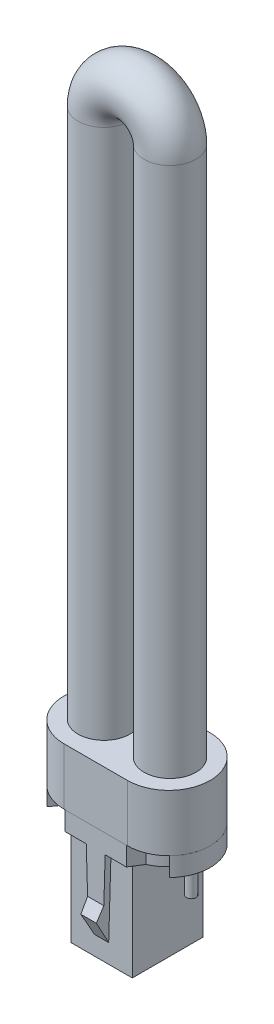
ISO-10303-21;
HEADER;
FILE_DESCRIPTION(('STEP AP214'),'2;1');
FILE_NAME('part.step','',(''),(''),'','','');
FILE_SCHEMA(('AUTOMOTIVE_DESIGN { 1 0 10303 214 1 1 1 1 }'));
ENDSEC;
DATA;
#1=APPLICATION_CONTEXT('core data for automotive mechanical design processes');
#2=APPLICATION_PROTOCOL_DEFINITION('international standard','automotive_design',2000,#1);
#3=PRODUCT_CONTEXT('',#1,'mechanical');
#4=PRODUCT('Part','Part','',(#3));
#5=PRODUCT_RELATED_PRODUCT_CATEGORY('part','',(#4));
#6=PRODUCT_DEFINITION_FORMATION('','',#4);
#7=PRODUCT_DEFINITION_CONTEXT('part definition',#1,'design');
#8=PRODUCT_DEFINITION('design','',#6,#7);
#9=PRODUCT_DEFINITION_SHAPE('','',#8);
#10=(LENGTH_UNIT() NAMED_UNIT(*) SI_UNIT(.MILLI.,.METRE.));
#11=(NAMED_UNIT(*) PLANE_ANGLE_UNIT() SI_UNIT($,.RADIAN.));
#12=(NAMED_UNIT(*) SI_UNIT($,.STERADIAN.) SOLID_ANGLE_UNIT());
#13=UNCERTAINTY_MEASURE_WITH_UNIT(LENGTH_MEASURE(1.E-05),#10,'distance_accuracy_value','');
#14=(GEOMETRIC_REPRESENTATION_CONTEXT(3) GLOBAL_UNCERTAINTY_ASSIGNED_CONTEXT((#13)) GLOBAL_UNIT_ASSIGNED_CONTEXT((#10,
#11,#12)) REPRESENTATION_CONTEXT('',''));
#15=CARTESIAN_POINT('',(0.,0.,0.));
#16=DIRECTION('',(0.,0.,1.));
#17=DIRECTION('',(1.,0.,0.));
#18=AXIS2_PLACEMENT_3D('',#15,#16,#17);
#19=CARTESIAN_POINT('',(11.5,-23.,0.));
#20=DIRECTION('',(0.,1.,0.));
#21=DIRECTION('',(0.,0.,1.));
#22=AXIS2_PLACEMENT_3D('',#19,#20,#21);
#23=CYLINDRICAL_SURFACE('',#22,1.);
#24=CARTESIAN_POINT('',(11.5,-23.,0.));
#25=DIRECTION('',(0.,-1.,0.));
#26=DIRECTION('',(0.,0.,-1.));
#27=AXIS2_PLACEMENT_3D('',#24,#25,#26);
#28=CIRCLE('',#27,1.);
#29=CARTESIAN_POINT('',(11.5,-23.,-0.999999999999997));
#30=VERTEX_POINT('',#29);
#31=EDGE_CURVE('E11',#30,#30,#28,.T.);
#32=ORIENTED_EDGE('',*,*,#31,.F.);
#33=EDGE_LOOP('',(#32));
#34=FACE_BOUND('',#33,.T.);
#35=CARTESIAN_POINT('',(11.5,-16.,0.));
#36=DIRECTION('',(0.,-1.,0.));
#37=DIRECTION('',(0.,0.,-1.));
#38=AXIS2_PLACEMENT_3D('',#35,#36,#37);
#39=CIRCLE('',#38,1.);
#40=CARTESIAN_POINT('',(11.5,-16.,-0.999999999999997));
#41=VERTEX_POINT('',#40);
#42=EDGE_CURVE('E47',#41,#41,#39,.T.);
#43=ORIENTED_EDGE('',*,*,#42,.T.);
#44=EDGE_LOOP('',(#43));
#45=FACE_BOUND('',#44,.T.);
#46=ADVANCED_FACE('F44',(#34,#45),#23,.T.);
#47=CARTESIAN_POINT('',(11.5,-23.,0.));
#48=DIRECTION('',(0.,-1.,0.));
#49=DIRECTION('',(0.,0.,-1.));
#50=AXIS2_PLACEMENT_3D('',#47,#48,#49);
#51=PLANE('',#50);
#52=ORIENTED_EDGE('',*,*,#31,.T.);
#53=EDGE_LOOP('',(#52));
#54=FACE_BOUND('',#53,.T.);
#55=ADVANCED_FACE('F59',(#54),#51,.T.);
#56=CARTESIAN_POINT('',(11.5,-16.,0.));
#57=DIRECTION('',(0.,-1.,0.));
#58=DIRECTION('',(0.,0.,-1.));
#59=AXIS2_PLACEMENT_3D('',#56,#57,#58);
#60=PLANE('',#59);
#61=ORIENTED_EDGE('',*,*,#42,.F.);
#62=EDGE_LOOP('',(#61));
#63=FACE_BOUND('',#62,.T.);
#64=ADVANCED_FACE('F57',(#63),#60,.F.);
#65=CLOSED_SHELL('',(#46,#55,#64));
#66=MANIFOLD_SOLID_BREP('B2',#65);
#67=CARTESIAN_POINT('',(-11.5,-23.,0.));
#68=DIRECTION('',(0.,1.,0.));
#69=DIRECTION('',(0.,0.,1.));
#70=AXIS2_PLACEMENT_3D('',#67,#68,#69);
#71=CYLINDRICAL_SURFACE('',#70,1.);
#72=CARTESIAN_POINT('',(-11.5,-23.,0.));
#73=DIRECTION('',(0.,-1.,0.));
#74=DIRECTION('',(0.,0.,-1.));
#75=AXIS2_PLACEMENT_3D('',#72,#73,#74);
#76=CIRCLE('',#75,1.);
#77=CARTESIAN_POINT('',(-11.5,-23.,-1.));
#78=VERTEX_POINT('',#77);
#79=EDGE_CURVE('E43',#78,#78,#76,.T.);
#80=ORIENTED_EDGE('',*,*,#79,.F.);
#81=EDGE_LOOP('',(#80));
#82=FACE_BOUND('',#81,.T.);
#83=CARTESIAN_POINT('',(-11.5,-16.,0.));
#84=DIRECTION('',(0.,-1.,0.));
#85=DIRECTION('',(0.,0.,-1.));
#86=AXIS2_PLACEMENT_3D('',#83,#84,#85);
#87=CIRCLE('',#86,1.);
#88=CARTESIAN_POINT('',(-11.5,-16.,-1.));
#89=VERTEX_POINT('',#88);
#90=EDGE_CURVE('E98',#89,#89,#87,.T.);
#91=ORIENTED_EDGE('',*,*,#90,.T.);
#92=EDGE_LOOP('',(#91));
#93=FACE_BOUND('',#92,.T.);
#94=ADVANCED_FACE('F95',(#82,#93),#71,.T.);
#95=CARTESIAN_POINT('',(-11.5,-23.,0.));
#96=DIRECTION('',(0.,-1.,0.));
#97=DIRECTION('',(0.,0.,-1.));
#98=AXIS2_PLACEMENT_3D('',#95,#96,#97);
#99=PLANE('',#98);
#100=ORIENTED_EDGE('',*,*,#79,.T.);
#101=EDGE_LOOP('',(#100));
#102=FACE_BOUND('',#101,.T.);
#103=ADVANCED_FACE('F110',(#102),#99,.T.);
#104=CARTESIAN_POINT('',(-11.5,-16.,0.));
#105=DIRECTION('',(0.,-1.,0.));
#106=DIRECTION('',(0.,0.,-1.));
#107=AXIS2_PLACEMENT_3D('',#104,#105,#106);
#108=PLANE('',#107);
#109=ORIENTED_EDGE('',*,*,#90,.F.);
#110=EDGE_LOOP('',(#109));
#111=FACE_BOUND('',#110,.T.);
#112=ADVANCED_FACE('F108',(#111),#108,.F.);
#113=CLOSED_SHELL('',(#94,#103,#112));
#114=MANIFOLD_SOLID_BREP('B6',#113);
#115=CARTESIAN_POINT('',(-1.5,-33.,26.214249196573));
#116=DIRECTION('',(0.999567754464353,0.0293990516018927,0.));
#117=DIRECTION('',(-0.0293990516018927,0.999567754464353,0.));
#118=AXIS2_PLACEMENT_3D('',#115,#116,#117);
#119=PLANE('',#118);
#120=DIRECTION('',(0.0293990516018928,-0.999567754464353,0.));
#121=VECTOR('',#120,1.);
#122=CARTESIAN_POINT('',(-1.5,-33.,7.5));
#123=LINE('',#122,#121);
#124=CARTESIAN_POINT('',(-2.,-16.,7.5));
#125=VERTEX_POINT('',#124);
#126=CARTESIAN_POINT('',(-1.5,-33.,7.5));
#127=VERTEX_POINT('',#126);
#128=EDGE_CURVE('E362',#125,#127,#123,.T.);
#129=ORIENTED_EDGE('',*,*,#128,.T.);
#130=DIRECTION('',(-0.0257625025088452,0.875925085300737,0.481758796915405));
#131=VECTOR('',#130,1.);
#132=CARTESIAN_POINT('',(-1.57050611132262,-30.6027922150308,8.81846428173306));
#133=LINE('',#132,#131);
#134=CARTESIAN_POINT('',(-1.64705882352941,-28.,10.25));
#135=VERTEX_POINT('',#134);
#136=EDGE_CURVE('E345',#127,#135,#133,.T.);
#137=ORIENTED_EDGE('',*,*,#136,.T.);
#138=DIRECTION('',(-0.0252123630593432,0.857220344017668,-0.5143322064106));
#139=VECTOR('',#138,1.);
#140=CARTESIAN_POINT('',(-1.65051433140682,-27.882512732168,10.1795076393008));
#141=LINE('',#140,#139);
#142=CARTESIAN_POINT('',(-1.72058823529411,-25.5,8.75));
#143=VERTEX_POINT('',#142);
#144=EDGE_CURVE('E358',#135,#143,#141,.T.);
#145=ORIENTED_EDGE('',*,*,#144,.T.);
#146=DIRECTION('',(-0.0293990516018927,0.999567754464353,0.));
#147=VECTOR('',#146,1.);
#148=CARTESIAN_POINT('',(-1.5,-33.,8.75));
#149=LINE('',#148,#147);
#150=CARTESIAN_POINT('',(-2.,-16.,8.75));
#151=VERTEX_POINT('',#150);
#152=EDGE_CURVE('E379',#143,#151,#149,.T.);
#153=ORIENTED_EDGE('',*,*,#152,.T.);
#154=DIRECTION('',(0.,0.,-1.));
#155=VECTOR('',#154,1.);
#156=CARTESIAN_POINT('',(-2.,-16.,26.214249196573));
#157=LINE('',#156,#155);
#158=EDGE_CURVE('E366',#151,#125,#157,.T.);
#159=ORIENTED_EDGE('',*,*,#158,.T.);
#160=EDGE_LOOP('',(#129,#137,#145,#153,#159));
#161=FACE_BOUND('',#160,.T.);
#162=ADVANCED_FACE('F146',(#161),#119,.F.);
#163=CARTESIAN_POINT('',(2.,-16.,26.214249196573));
#164=DIRECTION('',(-0.999567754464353,0.0293990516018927,0.));
#165=DIRECTION('',(-0.0293990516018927,-0.999567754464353,0.));
#166=AXIS2_PLACEMENT_3D('',#163,#164,#165);
#167=PLANE('',#166);
#168=DIRECTION('',(0.0257625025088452,0.875925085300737,0.481758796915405));
#169=VECTOR('',#168,1.);
#170=CARTESIAN_POINT('',(1.57050611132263,-30.6027922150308,8.81846428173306));
#171=LINE('',#170,#169);
#172=CARTESIAN_POINT('',(1.5,-33.,7.5));
#173=VERTEX_POINT('',#172);
#174=CARTESIAN_POINT('',(1.64705882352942,-28.,10.25));
#175=VERTEX_POINT('',#174);
#176=EDGE_CURVE('E910',#173,#175,#171,.T.);
#177=ORIENTED_EDGE('',*,*,#176,.F.);
#178=DIRECTION('',(0.0293990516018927,0.999567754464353,0.));
#179=VECTOR('',#178,1.);
#180=CARTESIAN_POINT('',(2.,-16.,7.5));
#181=LINE('',#180,#179);
#182=CARTESIAN_POINT('',(2.,-16.,7.5));
#183=VERTEX_POINT('',#182);
#184=EDGE_CURVE('E365',#173,#183,#181,.T.);
#185=ORIENTED_EDGE('',*,*,#184,.T.);
#186=DIRECTION('',(0.,0.,-1.));
#187=VECTOR('',#186,1.);
#188=CARTESIAN_POINT('',(2.,-16.,26.214249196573));
#189=LINE('',#188,#187);
#190=CARTESIAN_POINT('',(2.,-16.,8.75));
#191=VERTEX_POINT('',#190);
#192=EDGE_CURVE('E376',#191,#183,#189,.T.);
#193=ORIENTED_EDGE('',*,*,#192,.F.);
#194=DIRECTION('',(-0.0293990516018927,-0.999567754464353,0.));
#195=VECTOR('',#194,1.);
#196=CARTESIAN_POINT('',(2.,-16.,8.75));
#197=LINE('',#196,#195);
#198=CARTESIAN_POINT('',(1.72058823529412,-25.5,8.75));
#199=VERTEX_POINT('',#198);
#200=EDGE_CURVE('E422',#191,#199,#197,.T.);
#201=ORIENTED_EDGE('',*,*,#200,.T.);
#202=DIRECTION('',(0.0252123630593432,0.857220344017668,-0.5143322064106));
#203=VECTOR('',#202,1.);
#204=CARTESIAN_POINT('',(1.65051433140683,-27.882512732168,10.1795076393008));
#205=LINE('',#204,#203);
#206=EDGE_CURVE('E907',#175,#199,#205,.T.);
#207=ORIENTED_EDGE('',*,*,#206,.F.);
#208=EDGE_LOOP('',(#177,#185,#193,#201,#207));
#209=FACE_BOUND('',#208,.T.);
#210=ADVANCED_FACE('F585',(#209),#167,.F.);
#211=CARTESIAN_POINT('',(-1.5,-33.,-26.214249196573));
#212=DIRECTION('',(0.999567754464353,0.0293990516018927,0.));
#213=DIRECTION('',(-0.0293990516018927,0.999567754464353,0.));
#214=AXIS2_PLACEMENT_3D('',#211,#212,#213);
#215=PLANE('',#214);
#216=DIRECTION('',(0.0257625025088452,-0.875925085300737,0.481758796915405));
#217=VECTOR('',#216,1.);
#218=CARTESIAN_POINT('',(-1.57050611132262,-30.6027922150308,-8.81846428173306));
#219=LINE('',#218,#217);
#220=CARTESIAN_POINT('',(-1.64705882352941,-28.,-10.25));
#221=VERTEX_POINT('',#220);
#222=CARTESIAN_POINT('',(-1.5,-33.,-7.5));
#223=VERTEX_POINT('',#222);
#224=EDGE_CURVE('E923',#221,#223,#219,.T.);
#225=ORIENTED_EDGE('',*,*,#224,.T.);
#226=DIRECTION('',(-0.0293990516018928,0.999567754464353,0.));
#227=VECTOR('',#226,1.);
#228=CARTESIAN_POINT('',(-1.5,-33.,-7.5));
#229=LINE('',#228,#227);
#230=CARTESIAN_POINT('',(-1.99999999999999,-16.,-7.5));
#231=VERTEX_POINT('',#230);
#232=EDGE_CURVE('E871',#223,#231,#229,.T.);
#233=ORIENTED_EDGE('',*,*,#232,.T.);
#234=DIRECTION('',(0.,0.,1.));
#235=VECTOR('',#234,1.);
#236=CARTESIAN_POINT('',(-2.,-16.,-26.214249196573));
#237=LINE('',#236,#235);
#238=CARTESIAN_POINT('',(-2.,-16.,-8.75));
#239=VERTEX_POINT('',#238);
#240=EDGE_CURVE('E870',#239,#231,#237,.T.);
#241=ORIENTED_EDGE('',*,*,#240,.F.);
#242=DIRECTION('',(0.0293990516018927,-0.999567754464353,0.));
#243=VECTOR('',#242,1.);
#244=CARTESIAN_POINT('',(-1.5,-33.,-8.75));
#245=LINE('',#244,#243);
#246=CARTESIAN_POINT('',(-1.72058823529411,-25.5,-8.75));
#247=VERTEX_POINT('',#246);
#248=EDGE_CURVE('E873',#239,#247,#245,.T.);
#249=ORIENTED_EDGE('',*,*,#248,.T.);
#250=DIRECTION('',(0.0252123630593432,-0.857220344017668,-0.5143322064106));
#251=VECTOR('',#250,1.);
#252=CARTESIAN_POINT('',(-1.65051433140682,-27.882512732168,-10.1795076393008));
#253=LINE('',#252,#251);
#254=EDGE_CURVE('E161',#247,#221,#253,.T.);
#255=ORIENTED_EDGE('',*,*,#254,.T.);
#256=EDGE_LOOP('',(#225,#233,#241,#249,#255));
#257=FACE_BOUND('',#256,.T.);
#258=ADVANCED_FACE('F590',(#257),#215,.F.);
#259=CARTESIAN_POINT('',(2.,-16.,-26.214249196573));
#260=DIRECTION('',(-0.999567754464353,0.0293990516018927,0.));
#261=DIRECTION('',(-0.0293990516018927,-0.999567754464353,0.));
#262=AXIS2_PLACEMENT_3D('',#259,#260,#261);
#263=PLANE('',#262);
#264=DIRECTION('',(-0.0293990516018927,-0.999567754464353,0.));
#265=VECTOR('',#264,1.);
#266=CARTESIAN_POINT('',(2.,-16.,-7.5));
#267=LINE('',#266,#265);
#268=CARTESIAN_POINT('',(2.,-16.,-7.5));
#269=VERTEX_POINT('',#268);
#270=CARTESIAN_POINT('',(1.5,-33.,-7.5));
#271=VERTEX_POINT('',#270);
#272=EDGE_CURVE('E869',#269,#271,#267,.T.);
#273=ORIENTED_EDGE('',*,*,#272,.T.);
#274=DIRECTION('',(-0.0257625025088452,-0.875925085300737,0.481758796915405));
#275=VECTOR('',#274,1.);
#276=CARTESIAN_POINT('',(1.57050611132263,-30.6027922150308,-8.81846428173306));
#277=LINE('',#276,#275);
#278=CARTESIAN_POINT('',(1.64705882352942,-28.,-10.25));
#279=VERTEX_POINT('',#278);
#280=EDGE_CURVE('E924',#279,#271,#277,.T.);
#281=ORIENTED_EDGE('',*,*,#280,.F.);
#282=DIRECTION('',(-0.0252123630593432,-0.857220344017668,-0.5143322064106));
#283=VECTOR('',#282,1.);
#284=CARTESIAN_POINT('',(1.65051433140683,-27.882512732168,-10.1795076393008));
#285=LINE('',#284,#283);
#286=CARTESIAN_POINT('',(1.72058823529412,-25.5,-8.75000000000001));
#287=VERTEX_POINT('',#286);
#288=EDGE_CURVE('E931',#287,#279,#285,.T.);
#289=ORIENTED_EDGE('',*,*,#288,.F.);
#290=DIRECTION('',(0.0293990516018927,0.999567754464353,0.));
#291=VECTOR('',#290,1.);
#292=CARTESIAN_POINT('',(2.,-16.,-8.75));
#293=LINE('',#292,#291);
#294=CARTESIAN_POINT('',(2.00000000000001,-16.,-8.75));
#295=VERTEX_POINT('',#294);
#296=EDGE_CURVE('E169',#287,#295,#293,.T.);
#297=ORIENTED_EDGE('',*,*,#296,.T.);
#298=DIRECTION('',(0.,0.,1.));
#299=VECTOR('',#298,1.);
#300=CARTESIAN_POINT('',(2.,-16.,-26.214249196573));
#301=LINE('',#300,#299);
#302=EDGE_CURVE('E860',#295,#269,#301,.T.);
#303=ORIENTED_EDGE('',*,*,#302,.T.);
#304=EDGE_LOOP('',(#273,#281,#289,#297,#303));
#305=FACE_BOUND('',#304,.T.);
#306=ADVANCED_FACE('F604',(#305),#263,.F.);
#307=CARTESIAN_POINT('',(-6.5,-16.,8.75));
#308=DIRECTION('',(0.,0.,-1.));
#309=DIRECTION('',(-1.,0.,0.));
#310=AXIS2_PLACEMENT_3D('',#307,#308,#309);
#311=PLANE('',#310);
#312=DIRECTION('',(-1.,0.,0.));
#313=VECTOR('',#312,1.);
#314=CARTESIAN_POINT('',(7.08312559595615,-25.5,8.75));
#315=LINE('',#314,#313);
#316=EDGE_CURVE('E357',#199,#143,#315,.T.);
#317=ORIENTED_EDGE('',*,*,#316,.F.);
#318=ORIENTED_EDGE('',*,*,#200,.F.);
#319=DIRECTION('',(-1.,0.,0.));
#320=VECTOR('',#319,1.);
#321=CARTESIAN_POINT('',(-6.5,-16.,8.75));
#322=LINE('',#321,#320);
#323=CARTESIAN_POINT('',(6.5,-16.,8.75));
#324=VERTEX_POINT('',#323);
#325=EDGE_CURVE('E414',#324,#191,#322,.T.);
#326=ORIENTED_EDGE('',*,*,#325,.F.);
#327=DIRECTION('',(0.,1.,0.));
#328=VECTOR('',#327,1.);
#329=CARTESIAN_POINT('',(6.5,-16.,8.75));
#330=LINE('',#329,#328);
#331=CARTESIAN_POINT('',(6.5,-12.,8.75));
#332=VERTEX_POINT('',#331);
#333=EDGE_CURVE('E453',#324,#332,#330,.T.);
#334=ORIENTED_EDGE('',*,*,#333,.T.);
#335=DIRECTION('',(-1.,0.,0.));
#336=VECTOR('',#335,1.);
#337=CARTESIAN_POINT('',(-6.5,-12.,8.75));
#338=LINE('',#337,#336);
#339=CARTESIAN_POINT('',(-6.5,-12.,8.75));
#340=VERTEX_POINT('',#339);
#341=EDGE_CURVE('E384',#332,#340,#338,.T.);
#342=ORIENTED_EDGE('',*,*,#341,.T.);
#343=DIRECTION('',(0.,1.,0.));
#344=VECTOR('',#343,1.);
#345=CARTESIAN_POINT('',(-6.5,-16.,8.75));
#346=LINE('',#345,#344);
#347=CARTESIAN_POINT('',(-6.5,-16.,8.75));
#348=VERTEX_POINT('',#347);
#349=EDGE_CURVE('E417',#348,#340,#346,.T.);
#350=ORIENTED_EDGE('',*,*,#349,.F.);
#351=EDGE_CURVE('E413',#151,#348,#322,.T.);
#352=ORIENTED_EDGE('',*,*,#351,.F.);
#353=ORIENTED_EDGE('',*,*,#152,.F.);
#354=EDGE_LOOP('',(#317,#318,#326,#334,#342,#350,#352,#353));
#355=FACE_BOUND('',#354,.T.);
#356=ADVANCED_FACE('F527',(#355),#311,.F.);
#357=CARTESIAN_POINT('',(-4.70965600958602,-16.,-1.58246882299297));
#358=DIRECTION('',(0.,-1.,0.));
#359=DIRECTION('',(0.,0.,-1.));
#360=AXIS2_PLACEMENT_3D('',#357,#358,#359);
#361=PLANE('',#360);
#362=DIRECTION('',(1.,0.,0.));
#363=VECTOR('',#362,1.);
#364=CARTESIAN_POINT('',(-6.5,-16.,-8.75));
#365=LINE('',#364,#363);
#366=CARTESIAN_POINT('',(-6.5,-16.,-8.75));
#367=VERTEX_POINT('',#366);
#368=EDGE_CURVE('E397',#367,#239,#365,.T.);
#369=ORIENTED_EDGE('',*,*,#368,.T.);
#370=ORIENTED_EDGE('',*,*,#240,.T.);
#371=DIRECTION('',(1.,0.,0.));
#372=VECTOR('',#371,1.);
#373=CARTESIAN_POINT('',(6.5,-16.,-7.5));
#374=LINE('',#373,#372);
#375=CARTESIAN_POINT('',(-6.5,-16.,-7.5));
#376=VERTEX_POINT('',#375);
#377=EDGE_CURVE('E865',#376,#231,#374,.T.);
#378=ORIENTED_EDGE('',*,*,#377,.F.);
#379=DIRECTION('',(0.,0.,-1.));
#380=VECTOR('',#379,1.);
#381=CARTESIAN_POINT('',(-6.5,-16.,-7.5));
#382=LINE('',#381,#380);
#383=CARTESIAN_POINT('',(-6.5,-16.,7.5));
#384=VERTEX_POINT('',#383);
#385=EDGE_CURVE('E866',#384,#376,#382,.T.);
#386=ORIENTED_EDGE('',*,*,#385,.F.);
#387=DIRECTION('',(-1.,0.,0.));
#388=VECTOR('',#387,1.);
#389=CARTESIAN_POINT('',(6.5,-16.,7.5));
#390=LINE('',#389,#388);
#391=EDGE_CURVE('E895',#125,#384,#390,.T.);
#392=ORIENTED_EDGE('',*,*,#391,.F.);
#393=ORIENTED_EDGE('',*,*,#158,.F.);
#394=ORIENTED_EDGE('',*,*,#351,.T.);
#395=DIRECTION('',(-0.533280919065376,0.,-0.845938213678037));
#396=VECTOR('',#395,1.);
#397=CARTESIAN_POINT('',(-6.5,-16.,8.75));
#398=LINE('',#397,#396);
#399=CARTESIAN_POINT('',(-8.09984275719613,-16.,6.21218535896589));
#400=VERTEX_POINT('',#399);
#401=EDGE_CURVE('E380',#348,#400,#398,.T.);
#402=ORIENTED_EDGE('',*,*,#401,.T.);
#403=CARTESIAN_POINT('',(-4.70965600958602,-16.,-1.58246882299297));
#404=DIRECTION('',(0.,-1.,0.));
#405=DIRECTION('',(0.,0.,-1.));
#406=AXIS2_PLACEMENT_3D('',#403,#404,#405);
#407=CIRCLE('',#406,8.5);
#408=CARTESIAN_POINT('',(-11.2895472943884,-16.,3.79851906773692));
#409=VERTEX_POINT('',#408);
#410=EDGE_CURVE('E383',#400,#409,#407,.T.);
#411=ORIENTED_EDGE('',*,*,#410,.T.);
#412=DIRECTION('',(-0.589394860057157,0.,0.807845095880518));
#413=VECTOR('',#412,1.);
#414=CARTESIAN_POINT('',(-11.2895472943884,-16.,3.79851906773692));
#415=LINE('',#414,#413);
#416=CARTESIAN_POINT('',(-12.9919659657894,-16.,6.13191331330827));
#417=VERTEX_POINT('',#416);
#418=EDGE_CURVE('E386',#409,#417,#415,.T.);
#419=ORIENTED_EDGE('',*,*,#418,.T.);
#420=CARTESIAN_POINT('',(-6.75000000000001,-16.,0.));
#421=DIRECTION('',(0.,-1.,0.));
#422=DIRECTION('',(0.,0.,-1.));
#423=AXIS2_PLACEMENT_3D('',#420,#421,#422);
#424=CIRCLE('',#423,8.74999999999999);
#425=CARTESIAN_POINT('',(-12.9919659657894,-16.,-6.13191331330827));
#426=VERTEX_POINT('',#425);
#427=EDGE_CURVE('E388',#417,#426,#424,.T.);
#428=ORIENTED_EDGE('',*,*,#427,.T.);
#429=DIRECTION('',(0.589394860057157,0.,0.807845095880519));
#430=VECTOR('',#429,1.);
#431=CARTESIAN_POINT('',(-11.2895472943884,-16.,-3.79851906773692));
#432=LINE('',#431,#430);
#433=CARTESIAN_POINT('',(-11.2895472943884,-16.,-3.79851906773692));
#434=VERTEX_POINT('',#433);
#435=EDGE_CURVE('E390',#426,#434,#432,.T.);
#436=ORIENTED_EDGE('',*,*,#435,.T.);
#437=CARTESIAN_POINT('',(-4.70965600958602,-16.,1.58246882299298));
#438=DIRECTION('',(0.,-1.,0.));
#439=DIRECTION('',(0.,0.,1.));
#440=AXIS2_PLACEMENT_3D('',#437,#438,#439);
#441=CIRCLE('',#440,8.5);
#442=CARTESIAN_POINT('',(-8.09984275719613,-16.,-6.21218535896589));
#443=VERTEX_POINT('',#442);
#444=EDGE_CURVE('E392',#434,#443,#441,.T.);
#445=ORIENTED_EDGE('',*,*,#444,.T.);
#446=DIRECTION('',(0.533280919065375,0.,-0.845938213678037));
#447=VECTOR('',#446,1.);
#448=CARTESIAN_POINT('',(-6.5,-16.,-8.75));
#449=LINE('',#448,#447);
#450=EDGE_CURVE('E394',#443,#367,#449,.T.);
#451=ORIENTED_EDGE('',*,*,#450,.T.);
#452=EDGE_LOOP('',(#369,#370,#378,#386,#392,#393,#394,#402,#411,#419,#428,#436,#445,#451));
#453=FACE_BOUND('',#452,.T.);
#454=ADVANCED_FACE('F515',(#453),#361,.T.);
#455=CARTESIAN_POINT('',(6.5,-16.,-7.5));
#456=VERTEX_POINT('',#455);
#457=EDGE_CURVE('E859',#269,#456,#374,.T.);
#458=ORIENTED_EDGE('',*,*,#457,.F.);
#459=ORIENTED_EDGE('',*,*,#302,.F.);
#460=CARTESIAN_POINT('',(6.5,-16.,-8.75));
#461=VERTEX_POINT('',#460);
#462=EDGE_CURVE('E396',#295,#461,#365,.T.);
#463=ORIENTED_EDGE('',*,*,#462,.T.);
#464=DIRECTION('',(0.533280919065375,0.,0.845938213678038));
#465=VECTOR('',#464,1.);
#466=CARTESIAN_POINT('',(6.5,-16.,-8.75));
#467=LINE('',#466,#465);
#468=CARTESIAN_POINT('',(8.09984275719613,-16.,-6.21218535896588));
#469=VERTEX_POINT('',#468);
#470=EDGE_CURVE('E399',#461,#469,#467,.T.);
#471=ORIENTED_EDGE('',*,*,#470,.T.);
#472=CARTESIAN_POINT('',(4.70965600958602,-16.,1.58246882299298));
#473=DIRECTION('',(0.,-1.,0.));
#474=DIRECTION('',(0.,0.,-1.));
#475=AXIS2_PLACEMENT_3D('',#472,#473,#474);
#476=CIRCLE('',#475,8.5);
#477=CARTESIAN_POINT('',(11.2895472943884,-16.,-3.79851906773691));
#478=VERTEX_POINT('',#477);
#479=EDGE_CURVE('E401',#469,#478,#476,.T.);
#480=ORIENTED_EDGE('',*,*,#479,.T.);
#481=DIRECTION('',(0.589394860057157,0.,-0.807845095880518));
#482=VECTOR('',#481,1.);
#483=CARTESIAN_POINT('',(11.2895472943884,-16.,-3.79851906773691));
#484=LINE('',#483,#482);
#485=CARTESIAN_POINT('',(12.9919659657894,-16.,-6.13191331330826));
#486=VERTEX_POINT('',#485);
#487=EDGE_CURVE('E403',#478,#486,#484,.T.);
#488=ORIENTED_EDGE('',*,*,#487,.T.);
#489=CARTESIAN_POINT('',(6.75000000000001,-16.,0.));
#490=DIRECTION('',(0.,-1.,0.));
#491=DIRECTION('',(0.,0.,1.));
#492=AXIS2_PLACEMENT_3D('',#489,#490,#491);
#493=CIRCLE('',#492,8.74999999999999);
#494=CARTESIAN_POINT('',(12.9919659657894,-16.,6.13191331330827));
#495=VERTEX_POINT('',#494);
#496=EDGE_CURVE('E405',#486,#495,#493,.T.);
#497=ORIENTED_EDGE('',*,*,#496,.T.);
#498=DIRECTION('',(-0.589394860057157,0.,-0.807845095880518));
#499=VECTOR('',#498,1.);
#500=CARTESIAN_POINT('',(11.2895472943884,-16.,3.79851906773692));
#501=LINE('',#500,#499);
#502=CARTESIAN_POINT('',(11.2895472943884,-16.,3.79851906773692));
#503=VERTEX_POINT('',#502);
#504=EDGE_CURVE('E407',#495,#503,#501,.T.);
#505=ORIENTED_EDGE('',*,*,#504,.T.);
#506=CARTESIAN_POINT('',(4.70965600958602,-16.,-1.58246882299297));
#507=DIRECTION('',(0.,-1.,0.));
#508=DIRECTION('',(0.,0.,1.));
#509=AXIS2_PLACEMENT_3D('',#506,#507,#508);
#510=CIRCLE('',#509,8.5);
#511=CARTESIAN_POINT('',(8.09984275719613,-16.,6.21218535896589));
#512=VERTEX_POINT('',#511);
#513=EDGE_CURVE('E409',#503,#512,#510,.T.);
#514=ORIENTED_EDGE('',*,*,#513,.T.);
#515=DIRECTION('',(-0.533280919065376,0.,0.845938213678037));
#516=VECTOR('',#515,1.);
#517=CARTESIAN_POINT('',(6.5,-16.,8.75));
#518=LINE('',#517,#516);
#519=EDGE_CURVE('E411',#512,#324,#518,.T.);
#520=ORIENTED_EDGE('',*,*,#519,.T.);
#521=ORIENTED_EDGE('',*,*,#325,.T.);
#522=ORIENTED_EDGE('',*,*,#192,.T.);
#523=CARTESIAN_POINT('',(6.5,-16.,7.5));
#524=VERTEX_POINT('',#523);
#525=EDGE_CURVE('E884',#524,#183,#390,.T.);
#526=ORIENTED_EDGE('',*,*,#525,.F.);
#527=DIRECTION('',(0.,0.,1.));
#528=VECTOR('',#527,1.);
#529=CARTESIAN_POINT('',(6.5,-16.,-7.5));
#530=LINE('',#529,#528);
#531=EDGE_CURVE('E862',#456,#524,#530,.T.);
#532=ORIENTED_EDGE('',*,*,#531,.F.);
#533=EDGE_LOOP('',(#458,#459,#463,#471,#480,#488,#497,#505,#514,#520,#521,#522,#526,#532));
#534=FACE_BOUND('',#533,.T.);
#535=ADVANCED_FACE('F599',(#534),#361,.T.);
#536=CARTESIAN_POINT('',(6.5,-37.,-7.5));
#537=DIRECTION('',(0.,0.,1.));
#538=DIRECTION('',(1.,0.,0.));
#539=AXIS2_PLACEMENT_3D('',#536,#537,#538);
#540=PLANE('',#539);
#541=ORIENTED_EDGE('',*,*,#232,.F.);
#542=DIRECTION('',(-1.,0.,0.));
#543=VECTOR('',#542,1.);
#544=CARTESIAN_POINT('',(1.5,-33.,-7.5));
#545=LINE('',#544,#543);
#546=EDGE_CURVE('E876',#271,#223,#545,.T.);
#547=ORIENTED_EDGE('',*,*,#546,.F.);
#548=ORIENTED_EDGE('',*,*,#272,.F.);
#549=ORIENTED_EDGE('',*,*,#457,.T.);
#550=DIRECTION('',(0.,1.,0.));
#551=VECTOR('',#550,1.);
#552=CARTESIAN_POINT('',(6.5,-37.,-7.5));
#553=LINE('',#552,#551);
#554=CARTESIAN_POINT('',(6.5,-37.,-7.5));
#555=VERTEX_POINT('',#554);
#556=EDGE_CURVE('E902',#555,#456,#553,.T.);
#557=ORIENTED_EDGE('',*,*,#556,.F.);
#558=DIRECTION('',(1.,0.,0.));
#559=VECTOR('',#558,1.);
#560=CARTESIAN_POINT('',(6.5,-37.,-7.5));
#561=LINE('',#560,#559);
#562=CARTESIAN_POINT('',(-6.5,-37.,-7.5));
#563=VERTEX_POINT('',#562);
#564=EDGE_CURVE('E883',#563,#555,#561,.T.);
#565=ORIENTED_EDGE('',*,*,#564,.F.);
#566=DIRECTION('',(0.,1.,0.));
#567=VECTOR('',#566,1.);
#568=CARTESIAN_POINT('',(-6.5,-37.,-7.5));
#569=LINE('',#568,#567);
#570=EDGE_CURVE('E371',#563,#376,#569,.T.);
#571=ORIENTED_EDGE('',*,*,#570,.T.);
#572=ORIENTED_EDGE('',*,*,#377,.T.);
#573=EDGE_LOOP('',(#541,#547,#548,#549,#557,#565,#571,#572));
#574=FACE_BOUND('',#573,.T.);
#575=ADVANCED_FACE('F752',(#574),#540,.F.);
#576=CARTESIAN_POINT('',(-6.5,-16.,8.75));
#577=DIRECTION('',(0.845938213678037,0.,-0.533280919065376));
#578=DIRECTION('',(-0.533280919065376,0.,-0.845938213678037));
#579=AXIS2_PLACEMENT_3D('',#576,#577,#578);
#580=PLANE('',#579);
#581=DIRECTION('',(-0.533280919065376,0.,-0.845938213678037));
#582=VECTOR('',#581,1.);
#583=CARTESIAN_POINT('',(-6.5,-12.,8.75));
#584=LINE('',#583,#582);
#585=CARTESIAN_POINT('',(-8.09984275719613,-12.,6.21218535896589));
#586=VERTEX_POINT('',#585);
#587=EDGE_CURVE('E418',#340,#586,#584,.T.);
#588=ORIENTED_EDGE('',*,*,#587,.T.);
#589=DIRECTION('',(0.,1.,0.));
#590=VECTOR('',#589,1.);
#591=CARTESIAN_POINT('',(-8.09984275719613,-16.,6.21218535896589));
#592=LINE('',#591,#590);
#593=EDGE_CURVE('E93',#400,#586,#592,.T.);
#594=ORIENTED_EDGE('',*,*,#593,.F.);
#595=ORIENTED_EDGE('',*,*,#401,.F.);
#596=ORIENTED_EDGE('',*,*,#349,.T.);
#597=EDGE_LOOP('',(#588,#594,#595,#596));
#598=FACE_BOUND('',#597,.T.);
#599=ADVANCED_FACE('F148',(#598),#580,.F.);
#600=CARTESIAN_POINT('',(-4.70965600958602,-16.,-1.58246882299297));
#601=DIRECTION('',(0.,1.,0.));
#602=DIRECTION('',(0.,0.,1.));
#603=AXIS2_PLACEMENT_3D('',#600,#601,#602);
#604=CYLINDRICAL_SURFACE('',#603,8.5);
#605=CARTESIAN_POINT('',(-4.70965600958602,-12.,-1.58246882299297));
#606=DIRECTION('',(0.,-1.,0.));
#607=DIRECTION('',(0.,0.,-1.));
#608=AXIS2_PLACEMENT_3D('',#605,#606,#607);
#609=CIRCLE('',#608,8.5);
#610=CARTESIAN_POINT('',(-11.2895472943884,-12.,3.79851906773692));
#611=VERTEX_POINT('',#610);
#612=EDGE_CURVE('E421',#586,#611,#609,.T.);
#613=ORIENTED_EDGE('',*,*,#612,.T.);
#614=DIRECTION('',(0.,1.,0.));
#615=VECTOR('',#614,1.);
#616=CARTESIAN_POINT('',(-11.2895472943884,-16.,3.79851906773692));
#617=LINE('',#616,#615);
#618=EDGE_CURVE('E154',#409,#611,#617,.T.);
#619=ORIENTED_EDGE('',*,*,#618,.F.);
#620=ORIENTED_EDGE('',*,*,#410,.F.);
#621=ORIENTED_EDGE('',*,*,#593,.T.);
#622=EDGE_LOOP('',(#613,#619,#620,#621));
#623=FACE_BOUND('',#622,.T.);
#624=ADVANCED_FACE('F519',(#623),#604,.T.);
#625=CARTESIAN_POINT('',(-11.2895472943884,-16.,3.79851906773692));
#626=DIRECTION('',(-0.807845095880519,0.,-0.589394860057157));
#627=DIRECTION('',(-0.589394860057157,0.,0.807845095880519));
#628=AXIS2_PLACEMENT_3D('',#625,#626,#627);
#629=PLANE('',#628);
#630=DIRECTION('',(-0.589394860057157,0.,0.807845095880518));
#631=VECTOR('',#630,1.);
#632=CARTESIAN_POINT('',(-11.2895472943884,-12.,3.79851906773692));
#633=LINE('',#632,#631);
#634=CARTESIAN_POINT('',(-12.9919659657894,-12.,6.13191331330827));
#635=VERTEX_POINT('',#634);
#636=EDGE_CURVE('E424',#611,#635,#633,.T.);
#637=ORIENTED_EDGE('',*,*,#636,.T.);
#638=DIRECTION('',(0.,1.,0.));
#639=VECTOR('',#638,1.);
#640=CARTESIAN_POINT('',(-12.9919659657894,-16.,6.13191331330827));
#641=LINE('',#640,#639);
#642=EDGE_CURVE('E489',#417,#635,#641,.T.);
#643=ORIENTED_EDGE('',*,*,#642,.F.);
#644=ORIENTED_EDGE('',*,*,#418,.F.);
#645=ORIENTED_EDGE('',*,*,#618,.T.);
#646=EDGE_LOOP('',(#637,#643,#644,#645));
#647=FACE_BOUND('',#646,.T.);
#648=ADVANCED_FACE('F496',(#647),#629,.F.);
#649=CARTESIAN_POINT('',(-6.75000000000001,-16.,0.));
#650=DIRECTION('',(0.,1.,0.));
#651=DIRECTION('',(0.,0.,1.));
#652=AXIS2_PLACEMENT_3D('',#649,#650,#651);
#653=CYLINDRICAL_SURFACE('',#652,8.74999999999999);
#654=CARTESIAN_POINT('',(-6.75000000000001,-12.,0.));
#655=DIRECTION('',(0.,-1.,0.));
#656=DIRECTION('',(0.,0.,-1.));
#657=AXIS2_PLACEMENT_3D('',#654,#655,#656);
#658=CIRCLE('',#657,8.74999999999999);
#659=CARTESIAN_POINT('',(-12.9919659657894,-12.,-6.13191331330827));
#660=VERTEX_POINT('',#659);
#661=EDGE_CURVE('E426',#635,#660,#658,.T.);
#662=ORIENTED_EDGE('',*,*,#661,.T.);
#663=DIRECTION('',(0.,1.,0.));
#664=VECTOR('',#663,1.);
#665=CARTESIAN_POINT('',(-12.9919659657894,-16.,-6.13191331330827));
#666=LINE('',#665,#664);
#667=EDGE_CURVE('E486',#426,#660,#666,.T.);
#668=ORIENTED_EDGE('',*,*,#667,.F.);
#669=ORIENTED_EDGE('',*,*,#427,.F.);
#670=ORIENTED_EDGE('',*,*,#642,.T.);
#671=EDGE_LOOP('',(#662,#668,#669,#670));
#672=FACE_BOUND('',#671,.T.);
#673=ADVANCED_FACE('F507',(#672),#653,.T.);
#674=CARTESIAN_POINT('',(-11.2895472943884,-16.,-3.79851906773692));
#675=DIRECTION('',(-0.807845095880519,0.,0.589394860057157));
#676=DIRECTION('',(0.589394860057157,0.,0.807845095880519));
#677=AXIS2_PLACEMENT_3D('',#674,#675,#676);
#678=PLANE('',#677);
#679=DIRECTION('',(0.589394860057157,0.,0.807845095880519));
#680=VECTOR('',#679,1.);
#681=CARTESIAN_POINT('',(-11.2895472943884,-12.,-3.79851906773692));
#682=LINE('',#681,#680);
#683=CARTESIAN_POINT('',(-11.2895472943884,-12.,-3.79851906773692));
#684=VERTEX_POINT('',#683);
#685=EDGE_CURVE('E428',#660,#684,#682,.T.);
#686=ORIENTED_EDGE('',*,*,#685,.T.);
#687=DIRECTION('',(0.,1.,0.));
#688=VECTOR('',#687,1.);
#689=CARTESIAN_POINT('',(-11.2895472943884,-16.,-3.79851906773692));
#690=LINE('',#689,#688);
#691=EDGE_CURVE('E483',#434,#684,#690,.T.);
#692=ORIENTED_EDGE('',*,*,#691,.F.);
#693=ORIENTED_EDGE('',*,*,#435,.F.);
#694=ORIENTED_EDGE('',*,*,#667,.T.);
#695=EDGE_LOOP('',(#686,#692,#693,#694));
#696=FACE_BOUND('',#695,.T.);
#697=ADVANCED_FACE('F511',(#696),#678,.F.);
#698=CARTESIAN_POINT('',(-4.70965600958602,-16.,1.58246882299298));
#699=DIRECTION('',(0.,1.,0.));
#700=DIRECTION('',(0.,0.,1.));
#701=AXIS2_PLACEMENT_3D('',#698,#699,#700);
#702=CYLINDRICAL_SURFACE('',#701,8.5);
#703=CARTESIAN_POINT('',(-4.70965600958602,-12.,1.58246882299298));
#704=DIRECTION('',(0.,-1.,0.));
#705=DIRECTION('',(0.,0.,1.));
#706=AXIS2_PLACEMENT_3D('',#703,#704,#705);
#707=CIRCLE('',#706,8.5);
#708=CARTESIAN_POINT('',(-8.09984275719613,-12.,-6.21218535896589));
#709=VERTEX_POINT('',#708);
#710=EDGE_CURVE('E430',#684,#709,#707,.T.);
#711=ORIENTED_EDGE('',*,*,#710,.T.);
#712=DIRECTION('',(0.,1.,0.));
#713=VECTOR('',#712,1.);
#714=CARTESIAN_POINT('',(-8.09984275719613,-16.,-6.21218535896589));
#715=LINE('',#714,#713);
#716=EDGE_CURVE('E480',#443,#709,#715,.T.);
#717=ORIENTED_EDGE('',*,*,#716,.F.);
#718=ORIENTED_EDGE('',*,*,#444,.F.);
#719=ORIENTED_EDGE('',*,*,#691,.T.);
#720=EDGE_LOOP('',(#711,#717,#718,#719));
#721=FACE_BOUND('',#720,.T.);
#722=ADVANCED_FACE('F575',(#721),#702,.T.);
#723=CARTESIAN_POINT('',(-6.5,-16.,-8.75));
#724=DIRECTION('',(0.845938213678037,0.,0.533280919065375));
#725=DIRECTION('',(0.533280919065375,0.,-0.845938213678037));
#726=AXIS2_PLACEMENT_3D('',#723,#724,#725);
#727=PLANE('',#726);
#728=DIRECTION('',(0.533280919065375,0.,-0.845938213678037));
#729=VECTOR('',#728,1.);
#730=CARTESIAN_POINT('',(-6.5,-12.,-8.75));
#731=LINE('',#730,#729);
#732=CARTESIAN_POINT('',(-6.5,-12.,-8.75));
#733=VERTEX_POINT('',#732);
#734=EDGE_CURVE('E432',#709,#733,#731,.T.);
#735=ORIENTED_EDGE('',*,*,#734,.T.);
#736=DIRECTION('',(0.,1.,0.));
#737=VECTOR('',#736,1.);
#738=CARTESIAN_POINT('',(-6.5,-16.,-8.75));
#739=LINE('',#738,#737);
#740=EDGE_CURVE('E477',#367,#733,#739,.T.);
#741=ORIENTED_EDGE('',*,*,#740,.F.);
#742=ORIENTED_EDGE('',*,*,#450,.F.);
#743=ORIENTED_EDGE('',*,*,#716,.T.);
#744=EDGE_LOOP('',(#735,#741,#742,#743));
#745=FACE_BOUND('',#744,.T.);
#746=ADVANCED_FACE('F572',(#745),#727,.F.);
#747=CARTESIAN_POINT('',(-6.5,-16.,-8.75));
#748=DIRECTION('',(0.,0.,1.));
#749=DIRECTION('',(1.,0.,0.));
#750=AXIS2_PLACEMENT_3D('',#747,#748,#749);
#751=PLANE('',#750);
#752=ORIENTED_EDGE('',*,*,#296,.F.);
#753=DIRECTION('',(-1.,0.,0.));
#754=VECTOR('',#753,1.);
#755=CARTESIAN_POINT('',(7.08312559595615,-25.5,-8.75000000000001));
#756=LINE('',#755,#754);
#757=EDGE_CURVE('E935',#287,#247,#756,.T.);
#758=ORIENTED_EDGE('',*,*,#757,.T.);
#759=ORIENTED_EDGE('',*,*,#248,.F.);
#760=ORIENTED_EDGE('',*,*,#368,.F.);
#761=ORIENTED_EDGE('',*,*,#740,.T.);
#762=DIRECTION('',(1.,0.,0.));
#763=VECTOR('',#762,1.);
#764=CARTESIAN_POINT('',(-6.5,-12.,-8.75));
#765=LINE('',#764,#763);
#766=CARTESIAN_POINT('',(6.5,-12.,-8.75));
#767=VERTEX_POINT('',#766);
#768=EDGE_CURVE('E434',#733,#767,#765,.T.);
#769=ORIENTED_EDGE('',*,*,#768,.T.);
#770=DIRECTION('',(0.,1.,0.));
#771=VECTOR('',#770,1.);
#772=CARTESIAN_POINT('',(6.5,-16.,-8.75));
#773=LINE('',#772,#771);
#774=EDGE_CURVE('E474',#461,#767,#773,.T.);
#775=ORIENTED_EDGE('',*,*,#774,.F.);
#776=ORIENTED_EDGE('',*,*,#462,.F.);
#777=EDGE_LOOP('',(#752,#758,#759,#760,#761,#769,#775,#776));
#778=FACE_BOUND('',#777,.T.);
#779=ADVANCED_FACE('F567',(#778),#751,.F.);
#780=CARTESIAN_POINT('',(6.5,-16.,-8.75));
#781=DIRECTION('',(-0.845938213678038,0.,0.533280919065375));
#782=DIRECTION('',(0.533280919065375,0.,0.845938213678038));
#783=AXIS2_PLACEMENT_3D('',#780,#781,#782);
#784=PLANE('',#783);
#785=DIRECTION('',(0.533280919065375,0.,0.845938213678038));
#786=VECTOR('',#785,1.);
#787=CARTESIAN_POINT('',(6.5,-12.,-8.75));
#788=LINE('',#787,#786);
#789=CARTESIAN_POINT('',(8.09984275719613,-12.,-6.21218535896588));
#790=VERTEX_POINT('',#789);
#791=EDGE_CURVE('E436',#767,#790,#788,.T.);
#792=ORIENTED_EDGE('',*,*,#791,.T.);
#793=DIRECTION('',(0.,1.,0.));
#794=VECTOR('',#793,1.);
#795=CARTESIAN_POINT('',(8.09984275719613,-16.,-6.21218535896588));
#796=LINE('',#795,#794);
#797=EDGE_CURVE('E471',#469,#790,#796,.T.);
#798=ORIENTED_EDGE('',*,*,#797,.F.);
#799=ORIENTED_EDGE('',*,*,#470,.F.);
#800=ORIENTED_EDGE('',*,*,#774,.T.);
#801=EDGE_LOOP('',(#792,#798,#799,#800));
#802=FACE_BOUND('',#801,.T.);
#803=ADVANCED_FACE('F563',(#802),#784,.F.);
#804=CARTESIAN_POINT('',(4.70965600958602,-16.,1.58246882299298));
#805=DIRECTION('',(0.,1.,0.));
#806=DIRECTION('',(0.,0.,1.));
#807=AXIS2_PLACEMENT_3D('',#804,#805,#806);
#808=CYLINDRICAL_SURFACE('',#807,8.5);
#809=CARTESIAN_POINT('',(4.70965600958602,-12.,1.58246882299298));
#810=DIRECTION('',(0.,-1.,0.));
#811=DIRECTION('',(0.,0.,-1.));
#812=AXIS2_PLACEMENT_3D('',#809,#810,#811);
#813=CIRCLE('',#812,8.5);
#814=CARTESIAN_POINT('',(11.2895472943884,-12.,-3.79851906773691));
#815=VERTEX_POINT('',#814);
#816=EDGE_CURVE('E438',#790,#815,#813,.T.);
#817=ORIENTED_EDGE('',*,*,#816,.T.);
#818=DIRECTION('',(0.,1.,0.));
#819=VECTOR('',#818,1.);
#820=CARTESIAN_POINT('',(11.2895472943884,-16.,-3.79851906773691));
#821=LINE('',#820,#819);
#822=EDGE_CURVE('E468',#478,#815,#821,.T.);
#823=ORIENTED_EDGE('',*,*,#822,.F.);
#824=ORIENTED_EDGE('',*,*,#479,.F.);
#825=ORIENTED_EDGE('',*,*,#797,.T.);
#826=EDGE_LOOP('',(#817,#823,#824,#825));
#827=FACE_BOUND('',#826,.T.);
#828=ADVANCED_FACE('F558',(#827),#808,.T.);
#829=CARTESIAN_POINT('',(11.2895472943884,-16.,-3.79851906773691));
#830=DIRECTION('',(0.807845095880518,0.,0.589394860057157));
#831=DIRECTION('',(0.589394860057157,0.,-0.807845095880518));
#832=AXIS2_PLACEMENT_3D('',#829,#830,#831);
#833=PLANE('',#832);
#834=DIRECTION('',(0.589394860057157,0.,-0.807845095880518));
#835=VECTOR('',#834,1.);
#836=CARTESIAN_POINT('',(11.2895472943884,-12.,-3.79851906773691));
#837=LINE('',#836,#835);
#838=CARTESIAN_POINT('',(12.9919659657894,-12.,-6.13191331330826));
#839=VERTEX_POINT('',#838);
#840=EDGE_CURVE('E440',#815,#839,#837,.T.);
#841=ORIENTED_EDGE('',*,*,#840,.T.);
#842=DIRECTION('',(0.,1.,0.));
#843=VECTOR('',#842,1.);
#844=CARTESIAN_POINT('',(12.9919659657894,-16.,-6.13191331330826));
#845=LINE('',#844,#843);
#846=EDGE_CURVE('E465',#486,#839,#845,.T.);
#847=ORIENTED_EDGE('',*,*,#846,.F.);
#848=ORIENTED_EDGE('',*,*,#487,.F.);
#849=ORIENTED_EDGE('',*,*,#822,.T.);
#850=EDGE_LOOP('',(#841,#847,#848,#849));
#851=FACE_BOUND('',#850,.T.);
#852=ADVANCED_FACE('F552',(#851),#833,.F.);
#853=CARTESIAN_POINT('',(6.75000000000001,-16.,0.));
#854=DIRECTION('',(0.,1.,0.));
#855=DIRECTION('',(0.,0.,1.));
#856=AXIS2_PLACEMENT_3D('',#853,#854,#855);
#857=CYLINDRICAL_SURFACE('',#856,8.74999999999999);
#858=CARTESIAN_POINT('',(6.75000000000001,-12.,0.));
#859=DIRECTION('',(0.,-1.,0.));
#860=DIRECTION('',(0.,0.,1.));
#861=AXIS2_PLACEMENT_3D('',#858,#859,#860);
#862=CIRCLE('',#861,8.74999999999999);
#863=CARTESIAN_POINT('',(12.9919659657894,-12.,6.13191331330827));
#864=VERTEX_POINT('',#863);
#865=EDGE_CURVE('E442',#839,#864,#862,.T.);
#866=ORIENTED_EDGE('',*,*,#865,.T.);
#867=DIRECTION('',(0.,1.,0.));
#868=VECTOR('',#867,1.);
#869=CARTESIAN_POINT('',(12.9919659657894,-16.,6.13191331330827));
#870=LINE('',#869,#868);
#871=EDGE_CURVE('E462',#495,#864,#870,.T.);
#872=ORIENTED_EDGE('',*,*,#871,.F.);
#873=ORIENTED_EDGE('',*,*,#496,.F.);
#874=ORIENTED_EDGE('',*,*,#846,.T.);
#875=EDGE_LOOP('',(#866,#872,#873,#874));
#876=FACE_BOUND('',#875,.T.);
#877=ADVANCED_FACE('F548',(#876),#857,.T.);
#878=CARTESIAN_POINT('',(11.2895472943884,-16.,3.79851906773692));
#879=DIRECTION('',(0.807845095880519,0.,-0.589394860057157));
#880=DIRECTION('',(-0.589394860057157,0.,-0.807845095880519));
#881=AXIS2_PLACEMENT_3D('',#878,#879,#880);
#882=PLANE('',#881);
#883=DIRECTION('',(-0.589394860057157,0.,-0.807845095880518));
#884=VECTOR('',#883,1.);
#885=CARTESIAN_POINT('',(11.2895472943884,-12.,3.79851906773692));
#886=LINE('',#885,#884);
#887=CARTESIAN_POINT('',(11.2895472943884,-12.,3.79851906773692));
#888=VERTEX_POINT('',#887);
#889=EDGE_CURVE('E444',#864,#888,#886,.T.);
#890=ORIENTED_EDGE('',*,*,#889,.T.);
#891=DIRECTION('',(0.,1.,0.));
#892=VECTOR('',#891,1.);
#893=CARTESIAN_POINT('',(11.2895472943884,-16.,3.79851906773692));
#894=LINE('',#893,#892);
#895=EDGE_CURVE('E459',#503,#888,#894,.T.);
#896=ORIENTED_EDGE('',*,*,#895,.F.);
#897=ORIENTED_EDGE('',*,*,#504,.F.);
#898=ORIENTED_EDGE('',*,*,#871,.T.);
#899=EDGE_LOOP('',(#890,#896,#897,#898));
#900=FACE_BOUND('',#899,.T.);
#901=ADVANCED_FACE('F543',(#900),#882,.F.);
#902=CARTESIAN_POINT('',(4.70965600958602,-16.,-1.58246882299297));
#903=DIRECTION('',(0.,1.,0.));
#904=DIRECTION('',(0.,0.,1.));
#905=AXIS2_PLACEMENT_3D('',#902,#903,#904);
#906=CYLINDRICAL_SURFACE('',#905,8.5);
#907=CARTESIAN_POINT('',(4.70965600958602,-12.,-1.58246882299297));
#908=DIRECTION('',(0.,-1.,0.));
#909=DIRECTION('',(0.,0.,1.));
#910=AXIS2_PLACEMENT_3D('',#907,#908,#909);
#911=CIRCLE('',#910,8.5);
#912=CARTESIAN_POINT('',(8.09984275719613,-12.,6.21218535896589));
#913=VERTEX_POINT('',#912);
#914=EDGE_CURVE('E446',#888,#913,#911,.T.);
#915=ORIENTED_EDGE('',*,*,#914,.T.);
#916=DIRECTION('',(0.,1.,0.));
#917=VECTOR('',#916,1.);
#918=CARTESIAN_POINT('',(8.09984275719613,-16.,6.21218535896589));
#919=LINE('',#918,#917);
#920=EDGE_CURVE('E456',#512,#913,#919,.T.);
#921=ORIENTED_EDGE('',*,*,#920,.F.);
#922=ORIENTED_EDGE('',*,*,#513,.F.);
#923=ORIENTED_EDGE('',*,*,#895,.T.);
#924=EDGE_LOOP('',(#915,#921,#922,#923));
#925=FACE_BOUND('',#924,.T.);
#926=ADVANCED_FACE('F537',(#925),#906,.T.);
#927=CARTESIAN_POINT('',(6.5,-16.,8.75));
#928=DIRECTION('',(-0.845938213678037,0.,-0.533280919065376));
#929=DIRECTION('',(-0.533280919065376,0.,0.845938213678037));
#930=AXIS2_PLACEMENT_3D('',#927,#928,#929);
#931=PLANE('',#930);
#932=DIRECTION('',(-0.533280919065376,0.,0.845938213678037));
#933=VECTOR('',#932,1.);
#934=CARTESIAN_POINT('',(6.5,-12.,8.75));
#935=LINE('',#934,#933);
#936=EDGE_CURVE('E448',#913,#332,#935,.T.);
#937=ORIENTED_EDGE('',*,*,#936,.T.);
#938=ORIENTED_EDGE('',*,*,#333,.F.);
#939=ORIENTED_EDGE('',*,*,#519,.F.);
#940=ORIENTED_EDGE('',*,*,#920,.T.);
#941=EDGE_LOOP('',(#937,#938,#939,#940));
#942=FACE_BOUND('',#941,.T.);
#943=ADVANCED_FACE('F533',(#942),#931,.F.);
#944=CARTESIAN_POINT('',(-4.70965600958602,-12.,-1.58246882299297));
#945=DIRECTION('',(0.,-1.,0.));
#946=DIRECTION('',(0.,0.,-1.));
#947=AXIS2_PLACEMENT_3D('',#944,#945,#946);
#948=PLANE('',#947);
#949=ORIENTED_EDGE('',*,*,#587,.F.);
#950=ORIENTED_EDGE('',*,*,#341,.F.);
#951=ORIENTED_EDGE('',*,*,#936,.F.);
#952=ORIENTED_EDGE('',*,*,#914,.F.);
#953=ORIENTED_EDGE('',*,*,#889,.F.);
#954=ORIENTED_EDGE('',*,*,#865,.F.);
#955=ORIENTED_EDGE('',*,*,#840,.F.);
#956=ORIENTED_EDGE('',*,*,#816,.F.);
#957=ORIENTED_EDGE('',*,*,#791,.F.);
#958=ORIENTED_EDGE('',*,*,#768,.F.);
#959=ORIENTED_EDGE('',*,*,#734,.F.);
#960=ORIENTED_EDGE('',*,*,#710,.F.);
#961=ORIENTED_EDGE('',*,*,#685,.F.);
#962=ORIENTED_EDGE('',*,*,#661,.F.);
#963=ORIENTED_EDGE('',*,*,#636,.F.);
#964=ORIENTED_EDGE('',*,*,#612,.F.);
#965=EDGE_LOOP('',(#949,#950,#951,#952,#953,#954,#955,#956,#957,#958,#959,#960,#961,#962,#963,#964));
#966=FACE_BOUND('',#965,.T.);
#967=ADVANCED_FACE('F502',(#966),#948,.F.);
#968=CARTESIAN_POINT('',(6.5,-37.,7.5));
#969=DIRECTION('',(0.,0.,-1.));
#970=DIRECTION('',(-1.,0.,0.));
#971=AXIS2_PLACEMENT_3D('',#968,#969,#970);
#972=PLANE('',#971);
#973=DIRECTION('',(1.,0.,0.));
#974=VECTOR('',#973,1.);
#975=CARTESIAN_POINT('',(1.5,-33.,7.5));
#976=LINE('',#975,#974);
#977=EDGE_CURVE('E349',#127,#173,#976,.T.);
#978=ORIENTED_EDGE('',*,*,#977,.F.);
#979=ORIENTED_EDGE('',*,*,#128,.F.);
#980=ORIENTED_EDGE('',*,*,#391,.T.);
#981=DIRECTION('',(0.,1.,0.));
#982=VECTOR('',#981,1.);
#983=CARTESIAN_POINT('',(-6.5,-37.,7.5));
#984=LINE('',#983,#982);
#985=CARTESIAN_POINT('',(-6.5,-37.,7.5));
#986=VERTEX_POINT('',#985);
#987=EDGE_CURVE('E890',#986,#384,#984,.T.);
#988=ORIENTED_EDGE('',*,*,#987,.F.);
#989=DIRECTION('',(-1.,0.,0.));
#990=VECTOR('',#989,1.);
#991=CARTESIAN_POINT('',(6.5,-37.,7.5));
#992=LINE('',#991,#990);
#993=CARTESIAN_POINT('',(6.5,-37.,7.5));
#994=VERTEX_POINT('',#993);
#995=EDGE_CURVE('E888',#994,#986,#992,.T.);
#996=ORIENTED_EDGE('',*,*,#995,.F.);
#997=DIRECTION('',(0.,1.,0.));
#998=VECTOR('',#997,1.);
#999=CARTESIAN_POINT('',(6.5,-37.,7.5));
#1000=LINE('',#999,#998);
#1001=EDGE_CURVE('E899',#994,#524,#1000,.T.);
#1002=ORIENTED_EDGE('',*,*,#1001,.T.);
#1003=ORIENTED_EDGE('',*,*,#525,.T.);
#1004=ORIENTED_EDGE('',*,*,#184,.F.);
#1005=EDGE_LOOP('',(#978,#979,#980,#988,#996,#1002,#1003,#1004));
#1006=FACE_BOUND('',#1005,.T.);
#1007=ADVANCED_FACE('F361',(#1006),#972,.F.);
#1008=CARTESIAN_POINT('',(-6.5,-37.,-7.5));
#1009=DIRECTION('',(1.,0.,0.));
#1010=DIRECTION('',(0.,0.,-1.));
#1011=AXIS2_PLACEMENT_3D('',#1008,#1009,#1010);
#1012=PLANE('',#1011);
#1013=ORIENTED_EDGE('',*,*,#385,.T.);
#1014=ORIENTED_EDGE('',*,*,#570,.F.);
#1015=DIRECTION('',(0.,0.,-1.));
#1016=VECTOR('',#1015,1.);
#1017=CARTESIAN_POINT('',(-6.5,-37.,-7.5));
#1018=LINE('',#1017,#1016);
#1019=EDGE_CURVE('E880',#986,#563,#1018,.T.);
#1020=ORIENTED_EDGE('',*,*,#1019,.F.);
#1021=ORIENTED_EDGE('',*,*,#987,.T.);
#1022=EDGE_LOOP('',(#1013,#1014,#1020,#1021));
#1023=FACE_BOUND('',#1022,.T.);
#1024=ADVANCED_FACE('F594',(#1023),#1012,.F.);
#1025=CARTESIAN_POINT('',(6.5,-37.,-7.5));
#1026=DIRECTION('',(-1.,0.,0.));
#1027=DIRECTION('',(0.,0.,1.));
#1028=AXIS2_PLACEMENT_3D('',#1025,#1026,#1027);
#1029=PLANE('',#1028);
#1030=ORIENTED_EDGE('',*,*,#531,.T.);
#1031=ORIENTED_EDGE('',*,*,#1001,.F.);
#1032=DIRECTION('',(0.,0.,1.));
#1033=VECTOR('',#1032,1.);
#1034=CARTESIAN_POINT('',(6.5,-37.,-7.5));
#1035=LINE('',#1034,#1033);
#1036=EDGE_CURVE('E886',#555,#994,#1035,.T.);
#1037=ORIENTED_EDGE('',*,*,#1036,.F.);
#1038=ORIENTED_EDGE('',*,*,#556,.T.);
#1039=EDGE_LOOP('',(#1030,#1031,#1037,#1038));
#1040=FACE_BOUND('',#1039,.T.);
#1041=ADVANCED_FACE('F672',(#1040),#1029,.F.);
#1042=CARTESIAN_POINT('',(0.,-37.,0.));
#1043=DIRECTION('',(0.,-1.,0.));
#1044=DIRECTION('',(0.,0.,-1.));
#1045=AXIS2_PLACEMENT_3D('',#1042,#1043,#1044);
#1046=PLANE('',#1045);
#1047=ORIENTED_EDGE('',*,*,#1019,.T.);
#1048=ORIENTED_EDGE('',*,*,#564,.T.);
#1049=ORIENTED_EDGE('',*,*,#1036,.T.);
#1050=ORIENTED_EDGE('',*,*,#995,.T.);
#1051=EDGE_LOOP('',(#1047,#1048,#1049,#1050));
#1052=FACE_BOUND('',#1051,.T.);
#1053=ADVANCED_FACE('F679',(#1052),#1046,.T.);
#1054=CARTESIAN_POINT('',(7.08312559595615,-30.7272727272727,8.75));
#1055=DIRECTION('',(0.,0.481918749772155,-0.876215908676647));
#1056=DIRECTION('',(0.,0.876215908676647,0.481918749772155));
#1057=AXIS2_PLACEMENT_3D('',#1054,#1055,#1056);
#1058=PLANE('',#1057);
#1059=ORIENTED_EDGE('',*,*,#136,.F.);
#1060=ORIENTED_EDGE('',*,*,#977,.T.);
#1061=ORIENTED_EDGE('',*,*,#176,.T.);
#1062=DIRECTION('',(-1.,0.,0.));
#1063=VECTOR('',#1062,1.);
#1064=CARTESIAN_POINT('',(7.08312559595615,-28.,10.25));
#1065=LINE('',#1064,#1063);
#1066=EDGE_CURVE('E352',#175,#135,#1065,.T.);
#1067=ORIENTED_EDGE('',*,*,#1066,.T.);
#1068=EDGE_LOOP('',(#1059,#1060,#1061,#1067));
#1069=FACE_BOUND('',#1068,.T.);
#1070=ADVANCED_FACE('F347',(#1069),#1058,.F.);
#1071=CARTESIAN_POINT('',(7.08312559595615,-28.,10.25));
#1072=DIRECTION('',(0.,-0.514495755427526,-0.857492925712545));
#1073=DIRECTION('',(0.,0.857492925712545,-0.514495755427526));
#1074=AXIS2_PLACEMENT_3D('',#1071,#1072,#1073);
#1075=PLANE('',#1074);
#1076=ORIENTED_EDGE('',*,*,#1066,.F.);
#1077=ORIENTED_EDGE('',*,*,#206,.T.);
#1078=ORIENTED_EDGE('',*,*,#316,.T.);
#1079=ORIENTED_EDGE('',*,*,#144,.F.);
#1080=EDGE_LOOP('',(#1076,#1077,#1078,#1079));
#1081=FACE_BOUND('',#1080,.T.);
#1082=ADVANCED_FACE('F694',(#1081),#1075,.F.);
#1083=CARTESIAN_POINT('',(7.08312559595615,-30.7272727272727,-8.75));
#1084=DIRECTION('',(0.,0.481918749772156,0.876215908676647));
#1085=DIRECTION('',(0.,-0.876215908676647,0.481918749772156));
#1086=AXIS2_PLACEMENT_3D('',#1083,#1084,#1085);
#1087=PLANE('',#1086);
#1088=DIRECTION('',(-1.,0.,0.));
#1089=VECTOR('',#1088,1.);
#1090=CARTESIAN_POINT('',(7.08312559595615,-28.,-10.25));
#1091=LINE('',#1090,#1089);
#1092=EDGE_CURVE('E928',#279,#221,#1091,.T.);
#1093=ORIENTED_EDGE('',*,*,#1092,.F.);
#1094=ORIENTED_EDGE('',*,*,#280,.T.);
#1095=ORIENTED_EDGE('',*,*,#546,.T.);
#1096=ORIENTED_EDGE('',*,*,#224,.F.);
#1097=EDGE_LOOP('',(#1093,#1094,#1095,#1096));
#1098=FACE_BOUND('',#1097,.T.);
#1099=ADVANCED_FACE('F701',(#1098),#1087,.F.);
#1100=CARTESIAN_POINT('',(7.08312559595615,-28.,-10.25));
#1101=DIRECTION('',(0.,-0.514495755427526,0.857492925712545));
#1102=DIRECTION('',(0.,-0.857492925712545,-0.514495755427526));
#1103=AXIS2_PLACEMENT_3D('',#1100,#1101,#1102);
#1104=PLANE('',#1103);
#1105=ORIENTED_EDGE('',*,*,#757,.F.);
#1106=ORIENTED_EDGE('',*,*,#288,.T.);
#1107=ORIENTED_EDGE('',*,*,#1092,.T.);
#1108=ORIENTED_EDGE('',*,*,#254,.F.);
#1109=EDGE_LOOP('',(#1105,#1106,#1107,#1108));
#1110=FACE_BOUND('',#1109,.T.);
#1111=ADVANCED_FACE('F709',(#1110),#1104,.F.);
#1112=CLOSED_SHELL('',(#162,#210,#258,#306,#356,#454,#535,#575,#599,#624,#648,#673,#697,#722,
#746,#779,#803,#828,#852,#877,#901,#926,#943,#967,#1007,#1024,#1041,#1053,#1070,#1082,#1099,#1111));
#1113=MANIFOLD_SOLID_BREP('B38',#1112);
#1114=CARTESIAN_POINT('',(-6.75000000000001,-12.,0.));
#1115=DIRECTION('',(0.,1.,0.));
#1116=DIRECTION('',(0.,0.,1.));
#1117=AXIS2_PLACEMENT_3D('',#1114,#1115,#1116);
#1118=CYLINDRICAL_SURFACE('',#1117,8.75);
#1119=CARTESIAN_POINT('',(-6.75000000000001,0.,0.));
#1120=DIRECTION('',(0.,1.,0.));
#1121=DIRECTION('',(0.,0.,1.));
#1122=AXIS2_PLACEMENT_3D('',#1119,#1120,#1121);
#1123=CIRCLE('',#1122,8.75);
#1124=CARTESIAN_POINT('',(-6.75000000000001,0.,-8.75));
#1125=VERTEX_POINT('',#1124);
#1126=CARTESIAN_POINT('',(-6.75000000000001,0.,8.75));
#1127=VERTEX_POINT('',#1126);
#1128=EDGE_CURVE('E1036',#1125,#1127,#1123,.T.);
#1129=ORIENTED_EDGE('',*,*,#1128,.F.);
#1130=DIRECTION('',(0.,1.,0.));
#1131=VECTOR('',#1130,1.);
#1132=CARTESIAN_POINT('',(-6.75000000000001,-12.,-8.75));
#1133=LINE('',#1132,#1131);
#1134=CARTESIAN_POINT('',(-6.75000000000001,-12.,-8.75));
#1135=VERTEX_POINT('',#1134);
#1136=EDGE_CURVE('E144',#1135,#1125,#1133,.T.);
#1137=ORIENTED_EDGE('',*,*,#1136,.F.);
#1138=CARTESIAN_POINT('',(-6.75000000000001,-12.,0.));
#1139=DIRECTION('',(0.,1.,0.));
#1140=DIRECTION('',(0.,0.,1.));
#1141=AXIS2_PLACEMENT_3D('',#1138,#1139,#1140);
#1142=CIRCLE('',#1141,8.75);
#1143=CARTESIAN_POINT('',(-6.75000000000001,-12.,8.75));
#1144=VERTEX_POINT('',#1143);
#1145=EDGE_CURVE('E1030',#1135,#1144,#1142,.T.);
#1146=ORIENTED_EDGE('',*,*,#1145,.T.);
#1147=DIRECTION('',(0.,1.,0.));
#1148=VECTOR('',#1147,1.);
#1149=CARTESIAN_POINT('',(-6.75000000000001,-12.,8.75));
#1150=LINE('',#1149,#1148);
#1151=EDGE_CURVE('E975',#1144,#1127,#1150,.T.);
#1152=ORIENTED_EDGE('',*,*,#1151,.T.);
#1153=EDGE_LOOP('',(#1129,#1137,#1146,#1152));
#1154=FACE_BOUND('',#1153,.T.);
#1155=ADVANCED_FACE('F972',(#1154),#1118,.T.);
#1156=CARTESIAN_POINT('',(-6.75000000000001,-12.,-8.75));
#1157=DIRECTION('',(0.,0.,-1.));
#1158=DIRECTION('',(-1.,0.,0.));
#1159=AXIS2_PLACEMENT_3D('',#1156,#1157,#1158);
#1160=PLANE('',#1159);
#1161=DIRECTION('',(-1.,0.,0.));
#1162=VECTOR('',#1161,1.);
#1163=CARTESIAN_POINT('',(-6.75000000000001,0.,-8.75));
#1164=LINE('',#1163,#1162);
#1165=CARTESIAN_POINT('',(6.75,0.,-8.75));
#1166=VERTEX_POINT('',#1165);
#1167=EDGE_CURVE('E1032',#1166,#1125,#1164,.T.);
#1168=ORIENTED_EDGE('',*,*,#1167,.F.);
#1169=DIRECTION('',(0.,1.,0.));
#1170=VECTOR('',#1169,1.);
#1171=CARTESIAN_POINT('',(6.75,-12.,-8.75));
#1172=LINE('',#1171,#1170);
#1173=CARTESIAN_POINT('',(6.75,-12.,-8.75));
#1174=VERTEX_POINT('',#1173);
#1175=EDGE_CURVE('E981',#1174,#1166,#1172,.T.);
#1176=ORIENTED_EDGE('',*,*,#1175,.F.);
#1177=DIRECTION('',(-1.,0.,0.));
#1178=VECTOR('',#1177,1.);
#1179=CARTESIAN_POINT('',(-6.75000000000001,-12.,-8.75));
#1180=LINE('',#1179,#1178);
#1181=EDGE_CURVE('E1027',#1174,#1135,#1180,.T.);
#1182=ORIENTED_EDGE('',*,*,#1181,.T.);
#1183=ORIENTED_EDGE('',*,*,#1136,.T.);
#1184=EDGE_LOOP('',(#1168,#1176,#1182,#1183));
#1185=FACE_BOUND('',#1184,.T.);
#1186=ADVANCED_FACE('F1046',(#1185),#1160,.T.);
#1187=CARTESIAN_POINT('',(6.75000000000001,-12.,0.));
#1188=DIRECTION('',(0.,1.,0.));
#1189=DIRECTION('',(0.,0.,1.));
#1190=AXIS2_PLACEMENT_3D('',#1187,#1188,#1189);
#1191=CYLINDRICAL_SURFACE('',#1190,8.75);
#1192=CARTESIAN_POINT('',(6.75000000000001,0.,0.));
#1193=DIRECTION('',(0.,1.,0.));
#1194=DIRECTION('',(0.,0.,1.));
#1195=AXIS2_PLACEMENT_3D('',#1192,#1193,#1194);
#1196=CIRCLE('',#1195,8.75);
#1197=CARTESIAN_POINT('',(6.75000000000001,0.,8.75));
#1198=VERTEX_POINT('',#1197);
#1199=EDGE_CURVE('E1022',#1198,#1166,#1196,.T.);
#1200=ORIENTED_EDGE('',*,*,#1199,.F.);
#1201=DIRECTION('',(0.,1.,0.));
#1202=VECTOR('',#1201,1.);
#1203=CARTESIAN_POINT('',(6.75000000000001,-12.,8.75));
#1204=LINE('',#1203,#1202);
#1205=CARTESIAN_POINT('',(6.75000000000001,-12.,8.75));
#1206=VERTEX_POINT('',#1205);
#1207=EDGE_CURVE('E1017',#1206,#1198,#1204,.T.);
#1208=ORIENTED_EDGE('',*,*,#1207,.F.);
#1209=CARTESIAN_POINT('',(6.75000000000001,-12.,0.));
#1210=DIRECTION('',(0.,1.,0.));
#1211=DIRECTION('',(0.,0.,1.));
#1212=AXIS2_PLACEMENT_3D('',#1209,#1210,#1211);
#1213=CIRCLE('',#1212,8.75);
#1214=EDGE_CURVE('E1020',#1206,#1174,#1213,.T.);
#1215=ORIENTED_EDGE('',*,*,#1214,.T.);
#1216=ORIENTED_EDGE('',*,*,#1175,.T.);
#1217=EDGE_LOOP('',(#1200,#1208,#1215,#1216));
#1218=FACE_BOUND('',#1217,.T.);
#1219=ADVANCED_FACE('F1019',(#1218),#1191,.T.);
#1220=CARTESIAN_POINT('',(-6.75000000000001,-12.,8.75));
#1221=DIRECTION('',(0.,0.,1.));
#1222=DIRECTION('',(1.,0.,0.));
#1223=AXIS2_PLACEMENT_3D('',#1220,#1221,#1222);
#1224=PLANE('',#1223);
#1225=DIRECTION('',(1.,0.,0.));
#1226=VECTOR('',#1225,1.);
#1227=CARTESIAN_POINT('',(-6.75000000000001,0.,8.75));
#1228=LINE('',#1227,#1226);
#1229=EDGE_CURVE('E1039',#1127,#1198,#1228,.T.);
#1230=ORIENTED_EDGE('',*,*,#1229,.F.);
#1231=ORIENTED_EDGE('',*,*,#1151,.F.);
#1232=DIRECTION('',(1.,0.,0.));
#1233=VECTOR('',#1232,1.);
#1234=CARTESIAN_POINT('',(-6.75000000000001,-12.,8.75));
#1235=LINE('',#1234,#1233);
#1236=EDGE_CURVE('E1026',#1144,#1206,#1235,.T.);
#1237=ORIENTED_EDGE('',*,*,#1236,.T.);
#1238=ORIENTED_EDGE('',*,*,#1207,.T.);
#1239=EDGE_LOOP('',(#1230,#1231,#1237,#1238));
#1240=FACE_BOUND('',#1239,.T.);
#1241=ADVANCED_FACE('F1029',(#1240),#1224,.T.);
#1242=CARTESIAN_POINT('',(-6.75000000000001,-12.,0.));
#1243=DIRECTION('',(0.,1.,0.));
#1244=DIRECTION('',(0.,0.,1.));
#1245=AXIS2_PLACEMENT_3D('',#1242,#1243,#1244);
#1246=PLANE('',#1245);
#1247=ORIENTED_EDGE('',*,*,#1145,.F.);
#1248=ORIENTED_EDGE('',*,*,#1181,.F.);
#1249=ORIENTED_EDGE('',*,*,#1214,.F.);
#1250=ORIENTED_EDGE('',*,*,#1236,.F.);
#1251=EDGE_LOOP('',(#1247,#1248,#1249,#1250));
#1252=FACE_BOUND('',#1251,.T.);
#1253=ADVANCED_FACE('F1025',(#1252),#1246,.F.);
#1254=CARTESIAN_POINT('',(-6.75000000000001,0.,0.));
#1255=DIRECTION('',(0.,1.,0.));
#1256=DIRECTION('',(0.,0.,1.));
#1257=AXIS2_PLACEMENT_3D('',#1254,#1255,#1256);
#1258=PLANE('',#1257);
#1259=ORIENTED_EDGE('',*,*,#1128,.T.);
#1260=ORIENTED_EDGE('',*,*,#1229,.T.);
#1261=ORIENTED_EDGE('',*,*,#1199,.T.);
#1262=ORIENTED_EDGE('',*,*,#1167,.T.);
#1263=EDGE_LOOP('',(#1259,#1260,#1261,#1262));
#1264=FACE_BOUND('',#1263,.T.);
#1265=ADVANCED_FACE('F1045',(#1264),#1258,.T.);
#1266=CLOSED_SHELL('',(#1155,#1186,#1219,#1241,#1253,#1265));
#1267=MANIFOLD_SOLID_BREP('B87',#1266);
#1268=CARTESIAN_POINT('',(7.,0.,0.));
#1269=DIRECTION('',(0.,1.,0.));
#1270=DIRECTION('',(0.,0.,1.));
#1271=AXIS2_PLACEMENT_3D('',#1268,#1269,#1270);
#1272=PLANE('',#1271);
#1273=CARTESIAN_POINT('',(7.,0.,0.));
#1274=DIRECTION('',(0.,1.,0.));
#1275=DIRECTION('',(0.,0.,1.));
#1276=AXIS2_PLACEMENT_3D('',#1273,#1274,#1275);
#1277=CIRCLE('',#1276,5.5);
#1278=CARTESIAN_POINT('',(7.,0.,5.5));
#1279=VERTEX_POINT('',#1278);
#1280=EDGE_CURVE('E1110',#1279,#1279,#1277,.T.);
#1281=ORIENTED_EDGE('',*,*,#1280,.F.);
#1282=EDGE_LOOP('',(#1281));
#1283=FACE_BOUND('',#1282,.T.);
#1284=ADVANCED_FACE('F1096',(#1283),#1272,.F.);
#1285=CARTESIAN_POINT('',(-7.,0.,0.));
#1286=DIRECTION('',(0.,-1.,0.));
#1287=DIRECTION('',(0.,0.,1.));
#1288=AXIS2_PLACEMENT_3D('',#1285,#1286,#1287);
#1289=PLANE('',#1288);
#1290=CARTESIAN_POINT('',(-7.,0.,0.));
#1291=DIRECTION('',(0.,-1.,0.));
#1292=DIRECTION('',(0.,0.,1.));
#1293=AXIS2_PLACEMENT_3D('',#1290,#1291,#1292);
#1294=CIRCLE('',#1293,5.5);
#1295=CARTESIAN_POINT('',(-7.,0.,5.5));
#1296=VERTEX_POINT('',#1295);
#1297=EDGE_CURVE('E971',#1296,#1296,#1294,.T.);
#1298=ORIENTED_EDGE('',*,*,#1297,.T.);
#1299=EDGE_LOOP('',(#1298));
#1300=FACE_BOUND('',#1299,.T.);
#1301=ADVANCED_FACE('F1119',(#1300),#1289,.T.);
#1302=CARTESIAN_POINT('',(7.,0.,0.));
#1303=DIRECTION('',(0.,1.,0.));
#1304=DIRECTION('',(0.,0.,1.));
#1305=AXIS2_PLACEMENT_3D('',#1302,#1303,#1304);
#1306=CYLINDRICAL_SURFACE('',#1305,5.5);
#1307=CARTESIAN_POINT('',(7.,112.5,0.));
#1308=DIRECTION('',(0.,1.,0.));
#1309=DIRECTION('',(0.,0.,1.));
#1310=AXIS2_PLACEMENT_3D('',#1307,#1308,#1309);
#1311=CIRCLE('',#1310,5.5);
#1312=CARTESIAN_POINT('',(12.5,112.5,0.));
#1313=VERTEX_POINT('',#1312);
#1314=EDGE_CURVE('E1106',#1313,#1313,#1311,.T.);
#1315=ORIENTED_EDGE('',*,*,#1314,.F.);
#1316=EDGE_LOOP('',(#1315));
#1317=FACE_BOUND('',#1316,.T.);
#1318=ORIENTED_EDGE('',*,*,#1280,.T.);
#1319=EDGE_LOOP('',(#1318));
#1320=FACE_BOUND('',#1319,.T.);
#1321=ADVANCED_FACE('F1116',(#1317,#1320),#1306,.T.);
#1322=CARTESIAN_POINT('',(0.,112.5,0.));
#1323=DIRECTION('',(0.,0.,1.));
#1324=DIRECTION('',(1.,0.,0.));
#1325=AXIS2_PLACEMENT_3D('',#1322,#1323,#1324);
#1326=TOROIDAL_SURFACE('',#1325,7.,5.5);
#1327=CARTESIAN_POINT('',(-7.,112.5,0.));
#1328=DIRECTION('',(0.,-1.,0.));
#1329=DIRECTION('',(0.,0.,1.));
#1330=AXIS2_PLACEMENT_3D('',#1327,#1328,#1329);
#1331=CIRCLE('',#1330,5.5);
#1332=CARTESIAN_POINT('',(-12.5,112.5,0.));
#1333=VERTEX_POINT('',#1332);
#1334=EDGE_CURVE('E1102',#1333,#1333,#1331,.T.);
#1335=CARTESIAN_POINT('',(0.,112.5,0.));
#1336=DIRECTION('',(0.,0.,1.));
#1337=DIRECTION('',(1.,0.,0.));
#1338=AXIS2_PLACEMENT_3D('',#1335,#1336,#1337);
#1339=CIRCLE('',#1338,12.5);
#1340=EDGE_CURVE('',#1313,#1333,#1339,.T.);
#1341=ORIENTED_EDGE('',*,*,#1314,.T.);
#1342=ORIENTED_EDGE('',*,*,#1334,.F.);
#1343=ORIENTED_EDGE('',*,*,#1340,.T.);
#1344=ORIENTED_EDGE('',*,*,#1340,.F.);
#1345=EDGE_LOOP('',(#1341,#1343,#1342,#1344));
#1346=FACE_BOUND('',#1345,.T.);
#1347=ADVANCED_FACE('F1125',(#1346),#1326,.T.);
#1348=CARTESIAN_POINT('',(-7.,112.5,0.));
#1349=DIRECTION('',(0.,-1.,0.));
#1350=DIRECTION('',(0.,0.,-1.));
#1351=AXIS2_PLACEMENT_3D('',#1348,#1349,#1350);
#1352=CYLINDRICAL_SURFACE('',#1351,5.5);
#1353=ORIENTED_EDGE('',*,*,#1297,.F.);
#1354=EDGE_LOOP('',(#1353));
#1355=FACE_BOUND('',#1354,.T.);
#1356=ORIENTED_EDGE('',*,*,#1334,.T.);
#1357=EDGE_LOOP('',(#1356));
#1358=FACE_BOUND('',#1357,.T.);
#1359=ADVANCED_FACE('F1123',(#1355,#1358),#1352,.T.);
#1360=CLOSED_SHELL('',(#1284,#1301,#1321,#1347,#1359));
#1361=MANIFOLD_SOLID_BREP('B138',#1360);
#1362=ADVANCED_BREP_SHAPE_REPRESENTATION('',(#18,#66,#114,#1113,#1267,#1361),#14);
#1363=SHAPE_DEFINITION_REPRESENTATION(#9,#1362);
ENDSEC;
END-ISO-10303-21;
